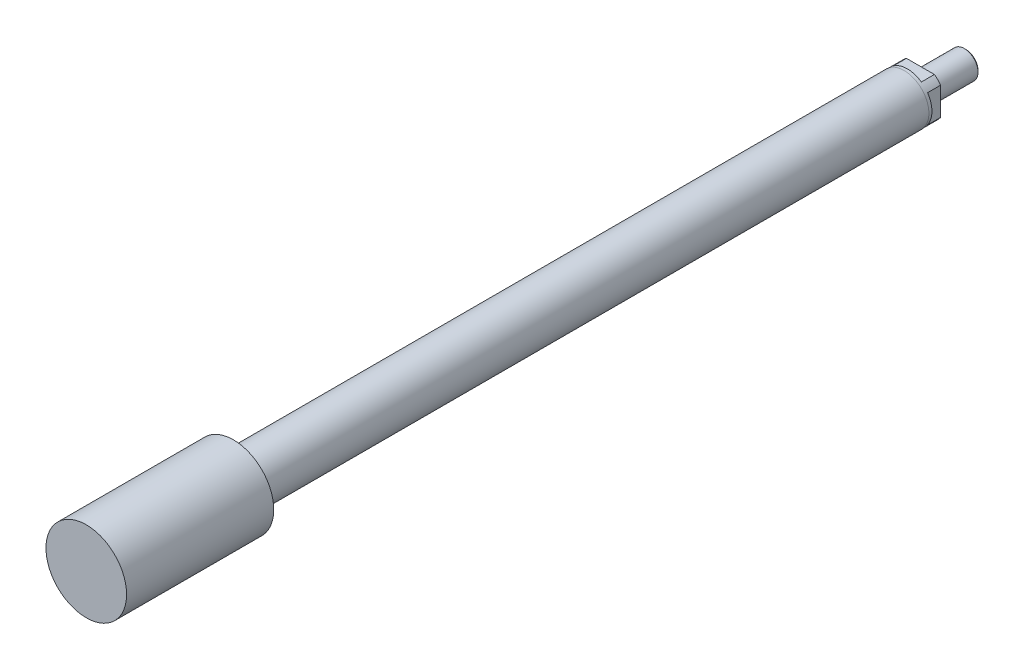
ISO-10303-21;
HEADER;
FILE_DESCRIPTION(('STEP AP214'),'2;1');
FILE_NAME('part.step','',(''),(''),'','','');
FILE_SCHEMA(('AUTOMOTIVE_DESIGN { 1 0 10303 214 1 1 1 1 }'));
ENDSEC;
DATA;
#1=APPLICATION_CONTEXT('core data for automotive mechanical design processes');
#2=APPLICATION_PROTOCOL_DEFINITION('international standard','automotive_design',2000,#1);
#3=PRODUCT_CONTEXT('',#1,'mechanical');
#4=PRODUCT('Part','Part','',(#3));
#5=PRODUCT_RELATED_PRODUCT_CATEGORY('part','',(#4));
#6=PRODUCT_DEFINITION_FORMATION('','',#4);
#7=PRODUCT_DEFINITION_CONTEXT('part definition',#1,'design');
#8=PRODUCT_DEFINITION('design','',#6,#7);
#9=PRODUCT_DEFINITION_SHAPE('','',#8);
#10=(LENGTH_UNIT() NAMED_UNIT(*) SI_UNIT(.MILLI.,.METRE.));
#11=(NAMED_UNIT(*) PLANE_ANGLE_UNIT() SI_UNIT($,.RADIAN.));
#12=(NAMED_UNIT(*) SI_UNIT($,.STERADIAN.) SOLID_ANGLE_UNIT());
#13=UNCERTAINTY_MEASURE_WITH_UNIT(LENGTH_MEASURE(1.E-05),#10,'distance_accuracy_value','');
#14=(GEOMETRIC_REPRESENTATION_CONTEXT(3) GLOBAL_UNCERTAINTY_ASSIGNED_CONTEXT((#13)) GLOBAL_UNIT_ASSIGNED_CONTEXT((#10,
#11,#12)) REPRESENTATION_CONTEXT('',''));
#15=CARTESIAN_POINT('',(0.,0.,0.));
#16=DIRECTION('',(0.,0.,1.));
#17=DIRECTION('',(1.,0.,0.));
#18=AXIS2_PLACEMENT_3D('',#15,#16,#17);
#19=CARTESIAN_POINT('',(0.,-37.719,-1161.15216));
#20=DIRECTION('',(0.,0.,1.));
#21=DIRECTION('',(-1.,0.,0.));
#22=AXIS2_PLACEMENT_3D('',#19,#20,#21);
#23=PLANE('',#22);
#24=CARTESIAN_POINT('',(0.,-2.9091818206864E-13,-1161.15216));
#25=DIRECTION('',(0.,0.,1.));
#26=DIRECTION('',(-1.,0.,0.));
#27=AXIS2_PLACEMENT_3D('',#24,#25,#26);
#28=CIRCLE('',#27,18.495999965);
#29=CARTESIAN_POINT('',(-18.4959999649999,-2.95025119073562E-13,-1161.15216));
#30=VERTEX_POINT('',#29);
#31=EDGE_CURVE('E117',#30,#30,#28,.T.);
#32=ORIENTED_EDGE('',*,*,#31,.T.);
#33=EDGE_LOOP('',(#32));
#34=FACE_BOUND('',#33,.T.);
#35=DIRECTION('',(0.,1.,0.));
#36=VECTOR('',#35,1.);
#37=CARTESIAN_POINT('',(-31.,-31.,-1161.15216));
#38=LINE('',#37,#36);
#39=CARTESIAN_POINT('',(-31.,-21.487739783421,-1161.15216));
#40=VERTEX_POINT('',#39);
#41=CARTESIAN_POINT('',(-31.,21.4877397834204,-1161.15216));
#42=VERTEX_POINT('',#41);
#43=EDGE_CURVE('E93',#40,#42,#38,.T.);
#44=ORIENTED_EDGE('',*,*,#43,.T.);
#45=CARTESIAN_POINT('',(0.,-2.9091818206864E-13,-1161.15216));
#46=DIRECTION('',(0.,0.,1.));
#47=DIRECTION('',(-1.,0.,0.));
#48=AXIS2_PLACEMENT_3D('',#45,#46,#47);
#49=CIRCLE('',#48,37.719);
#50=CARTESIAN_POINT('',(-21.4877397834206,31.,-1161.15216));
#51=VERTEX_POINT('',#50);
#52=EDGE_CURVE('E101',#51,#42,#49,.T.);
#53=ORIENTED_EDGE('',*,*,#52,.F.);
#54=DIRECTION('',(1.,0.,0.));
#55=VECTOR('',#54,1.);
#56=CARTESIAN_POINT('',(-31.,31.,-1161.15216));
#57=LINE('',#56,#55);
#58=CARTESIAN_POINT('',(21.4877397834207,31.,-1161.15216));
#59=VERTEX_POINT('',#58);
#60=EDGE_CURVE('E81',#51,#59,#57,.T.);
#61=ORIENTED_EDGE('',*,*,#60,.T.);
#62=CARTESIAN_POINT('',(31.,21.4877397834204,-1161.15216));
#63=VERTEX_POINT('',#62);
#64=EDGE_CURVE('E108',#63,#59,#49,.T.);
#65=ORIENTED_EDGE('',*,*,#64,.F.);
#66=DIRECTION('',(0.,-1.,0.));
#67=VECTOR('',#66,1.);
#68=CARTESIAN_POINT('',(31.,-31.,-1161.15216));
#69=LINE('',#68,#67);
#70=CARTESIAN_POINT('',(31.,-21.487739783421,-1161.15216));
#71=VERTEX_POINT('',#70);
#72=EDGE_CURVE('E92',#63,#71,#69,.T.);
#73=ORIENTED_EDGE('',*,*,#72,.T.);
#74=CARTESIAN_POINT('',(21.4877397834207,-31.,-1161.15216));
#75=VERTEX_POINT('',#74);
#76=EDGE_CURVE('E112',#75,#71,#49,.T.);
#77=ORIENTED_EDGE('',*,*,#76,.F.);
#78=DIRECTION('',(-1.,0.,0.));
#79=VECTOR('',#78,1.);
#80=CARTESIAN_POINT('',(-31.,-31.,-1161.15216));
#81=LINE('',#80,#79);
#82=CARTESIAN_POINT('',(-21.4877397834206,-31.,-1161.15216));
#83=VERTEX_POINT('',#82);
#84=EDGE_CURVE('E130',#75,#83,#81,.T.);
#85=ORIENTED_EDGE('',*,*,#84,.T.);
#86=EDGE_CURVE('E111',#40,#83,#49,.T.);
#87=ORIENTED_EDGE('',*,*,#86,.F.);
#88=EDGE_LOOP('',(#44,#53,#61,#65,#73,#77,#85,#87));
#89=FACE_BOUND('',#88,.T.);
#90=ADVANCED_FACE('F16',(#34,#89),#23,.F.);
#91=CARTESIAN_POINT('',(0.,-2.88030943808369E-13,-1076.00496));
#92=DIRECTION('',(0.,0.,1.));
#93=DIRECTION('',(-1.,0.,0.));
#94=AXIS2_PLACEMENT_3D('',#91,#92,#93);
#95=CYLINDRICAL_SURFACE('',#94,37.719);
#96=CARTESIAN_POINT('',(0.,-2.90070462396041E-13,-1136.15216));
#97=DIRECTION('',(0.,0.,1.));
#98=DIRECTION('',(-1.,0.,0.));
#99=AXIS2_PLACEMENT_3D('',#96,#97,#98);
#100=CIRCLE('',#99,37.719);
#101=CARTESIAN_POINT('',(-37.7189999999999,-2.98445762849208E-13,-1136.15216));
#102=VERTEX_POINT('',#101);
#103=EDGE_CURVE('E109',#102,#102,#100,.T.);
#104=ORIENTED_EDGE('',*,*,#103,.F.);
#105=EDGE_LOOP('',(#104));
#106=FACE_BOUND('',#105,.T.);
#107=DIRECTION('',(0.,0.,1.));
#108=VECTOR('',#107,1.);
#109=CARTESIAN_POINT('',(-31.,-21.487739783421,-1076.00496));
#110=LINE('',#109,#108);
#111=CARTESIAN_POINT('',(-31.,-21.487739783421,-1141.15216));
#112=VERTEX_POINT('',#111);
#113=EDGE_CURVE('E10',#40,#112,#110,.T.);
#114=ORIENTED_EDGE('',*,*,#113,.F.);
#115=ORIENTED_EDGE('',*,*,#86,.T.);
#116=DIRECTION('',(0.,0.,1.));
#117=VECTOR('',#116,1.);
#118=CARTESIAN_POINT('',(-21.4877397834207,-31.,-1076.00496));
#119=LINE('',#118,#117);
#120=CARTESIAN_POINT('',(-21.4877397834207,-31.,-1141.15216));
#121=VERTEX_POINT('',#120);
#122=EDGE_CURVE('E157',#121,#83,#119,.F.);
#123=ORIENTED_EDGE('',*,*,#122,.F.);
#124=CARTESIAN_POINT('',(0.,-2.9024000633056E-13,-1141.15216));
#125=DIRECTION('',(0.,0.,-1.));
#126=DIRECTION('',(1.,0.,0.));
#127=AXIS2_PLACEMENT_3D('',#124,#125,#126);
#128=CIRCLE('',#127,37.719);
#129=CARTESIAN_POINT('',(21.4877397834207,-31.,-1141.15216));
#130=VERTEX_POINT('',#129);
#131=EDGE_CURVE('E159',#130,#121,#128,.T.);
#132=ORIENTED_EDGE('',*,*,#131,.F.);
#133=DIRECTION('',(0.,0.,1.));
#134=VECTOR('',#133,1.);
#135=CARTESIAN_POINT('',(21.4877397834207,-31.,-1076.00496));
#136=LINE('',#135,#134);
#137=EDGE_CURVE('E127',#75,#130,#136,.T.);
#138=ORIENTED_EDGE('',*,*,#137,.F.);
#139=ORIENTED_EDGE('',*,*,#76,.T.);
#140=DIRECTION('',(0.,0.,1.));
#141=VECTOR('',#140,1.);
#142=CARTESIAN_POINT('',(31.,-21.487739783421,-1076.00496));
#143=LINE('',#142,#141);
#144=CARTESIAN_POINT('',(31.,-21.487739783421,-1141.15216));
#145=VERTEX_POINT('',#144);
#146=EDGE_CURVE('E104',#145,#71,#143,.F.);
#147=ORIENTED_EDGE('',*,*,#146,.F.);
#148=CARTESIAN_POINT('',(31.,21.4877397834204,-1141.15216));
#149=VERTEX_POINT('',#148);
#150=EDGE_CURVE('E146',#149,#145,#128,.T.);
#151=ORIENTED_EDGE('',*,*,#150,.F.);
#152=DIRECTION('',(0.,0.,1.));
#153=VECTOR('',#152,1.);
#154=CARTESIAN_POINT('',(31.,21.4877397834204,-1076.00496));
#155=LINE('',#154,#153);
#156=EDGE_CURVE('E155',#63,#149,#155,.T.);
#157=ORIENTED_EDGE('',*,*,#156,.F.);
#158=ORIENTED_EDGE('',*,*,#64,.T.);
#159=DIRECTION('',(0.,0.,1.));
#160=VECTOR('',#159,1.);
#161=CARTESIAN_POINT('',(21.4877397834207,31.,-1076.00496));
#162=LINE('',#161,#160);
#163=CARTESIAN_POINT('',(21.4877397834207,31.,-1141.15216));
#164=VERTEX_POINT('',#163);
#165=EDGE_CURVE('E87',#164,#59,#162,.F.);
#166=ORIENTED_EDGE('',*,*,#165,.F.);
#167=CARTESIAN_POINT('',(-21.4877397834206,31.,-1141.15216));
#168=VERTEX_POINT('',#167);
#169=EDGE_CURVE('E103',#168,#164,#128,.T.);
#170=ORIENTED_EDGE('',*,*,#169,.F.);
#171=DIRECTION('',(0.,0.,1.));
#172=VECTOR('',#171,1.);
#173=CARTESIAN_POINT('',(-21.4877397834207,31.,-1076.00496));
#174=LINE('',#173,#172);
#175=EDGE_CURVE('E84',#51,#168,#174,.T.);
#176=ORIENTED_EDGE('',*,*,#175,.F.);
#177=ORIENTED_EDGE('',*,*,#52,.T.);
#178=DIRECTION('',(0.,0.,1.));
#179=VECTOR('',#178,1.);
#180=CARTESIAN_POINT('',(-31.,21.4877397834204,-1076.00496));
#181=LINE('',#180,#179);
#182=CARTESIAN_POINT('',(-31.,21.4877397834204,-1141.15216));
#183=VERTEX_POINT('',#182);
#184=EDGE_CURVE('E161',#183,#42,#181,.F.);
#185=ORIENTED_EDGE('',*,*,#184,.F.);
#186=EDGE_CURVE('E25',#112,#183,#128,.T.);
#187=ORIENTED_EDGE('',*,*,#186,.F.);
#188=EDGE_LOOP('',(#114,#115,#123,#132,#138,#139,#147,#151,#157,#158,#166,#170,#176,#177,#185,#187));
#189=FACE_BOUND('',#188,.T.);
#190=ADVANCED_FACE('F99',(#106,#189),#95,.T.);
#191=CARTESIAN_POINT('',(0.,-2.93286710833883E-13,-1231.00216));
#192=DIRECTION('',(0.,0.,1.));
#193=DIRECTION('',(-1.,0.,0.));
#194=AXIS2_PLACEMENT_3D('',#191,#192,#193);
#195=PLANE('',#194);
#196=CARTESIAN_POINT('',(0.,-2.93286710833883E-13,-1231.00216));
#197=DIRECTION('',(0.,0.,1.));
#198=DIRECTION('',(-1.,0.,0.));
#199=AXIS2_PLACEMENT_3D('',#196,#197,#198);
#200=CIRCLE('',#199,18.714);
#201=CARTESIAN_POINT('',(-18.7139999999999,-2.9744205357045E-13,-1231.00216));
#202=VERTEX_POINT('',#201);
#203=EDGE_CURVE('E147',#202,#202,#200,.F.);
#204=ORIENTED_EDGE('',*,*,#203,.T.);
#205=EDGE_LOOP('',(#204));
#206=FACE_BOUND('',#205,.T.);
#207=ADVANCED_FACE('F222',(#206),#195,.F.);
#208=CARTESIAN_POINT('',(0.,-2.88030943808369E-13,-1076.00496));
#209=DIRECTION('',(0.,0.,1.));
#210=DIRECTION('',(-1.,0.,0.));
#211=AXIS2_PLACEMENT_3D('',#208,#209,#210);
#212=CYLINDRICAL_SURFACE('',#211,21.);
#213=CARTESIAN_POINT('',(0.,-2.9320919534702E-13,-1228.71616));
#214=DIRECTION('',(0.,0.,1.));
#215=DIRECTION('',(-1.,0.,0.));
#216=AXIS2_PLACEMENT_3D('',#213,#214,#215);
#217=CIRCLE('',#216,21.);
#218=CARTESIAN_POINT('',(-20.9999999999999,-2.97872132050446E-13,-1228.71616));
#219=VERTEX_POINT('',#218);
#220=EDGE_CURVE('E150',#219,#219,#217,.T.);
#221=ORIENTED_EDGE('',*,*,#220,.T.);
#222=EDGE_LOOP('',(#221));
#223=FACE_BOUND('',#222,.T.);
#224=CARTESIAN_POINT('',(0.,-2.91142115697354E-13,-1167.75616));
#225=DIRECTION('',(0.,0.,1.));
#226=DIRECTION('',(-1.,0.,0.));
#227=AXIS2_PLACEMENT_3D('',#224,#225,#226);
#228=CIRCLE('',#227,21.);
#229=CARTESIAN_POINT('',(-20.9999999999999,-2.9580505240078E-13,-1167.75616));
#230=VERTEX_POINT('',#229);
#231=EDGE_CURVE('E451',#230,#230,#228,.T.);
#232=ORIENTED_EDGE('',*,*,#231,.F.);
#233=EDGE_LOOP('',(#232));
#234=FACE_BOUND('',#233,.T.);
#235=ADVANCED_FACE('F225',(#223,#234),#212,.T.);
#236=CARTESIAN_POINT('',(0.,-21.0000000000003,-1167.75616));
#237=DIRECTION('',(0.,0.,-1.));
#238=DIRECTION('',(1.,0.,0.));
#239=AXIS2_PLACEMENT_3D('',#236,#237,#238);
#240=PLANE('',#239);
#241=CARTESIAN_POINT('',(0.,-2.91142115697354E-13,-1167.75616));
#242=DIRECTION('',(0.,0.,1.));
#243=DIRECTION('',(-1.,0.,0.));
#244=AXIS2_PLACEMENT_3D('',#241,#242,#243);
#245=CIRCLE('',#244,18.495999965);
#246=CARTESIAN_POINT('',(-18.4959999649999,-2.95249052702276E-13,-1167.75616));
#247=VERTEX_POINT('',#246);
#248=EDGE_CURVE('E120',#247,#247,#245,.T.);
#249=ORIENTED_EDGE('',*,*,#248,.F.);
#250=EDGE_LOOP('',(#249));
#251=FACE_BOUND('',#250,.T.);
#252=ORIENTED_EDGE('',*,*,#231,.T.);
#253=EDGE_LOOP('',(#252));
#254=FACE_BOUND('',#253,.T.);
#255=ADVANCED_FACE('F229',(#251,#254),#240,.F.);
#256=CARTESIAN_POINT('',(0.,-2.88030943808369E-13,-1076.00496));
#257=DIRECTION('',(0.,0.,1.));
#258=DIRECTION('',(-1.,0.,0.));
#259=AXIS2_PLACEMENT_3D('',#256,#257,#258);
#260=CYLINDRICAL_SURFACE('',#259,18.495999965);
#261=ORIENTED_EDGE('',*,*,#31,.F.);
#262=EDGE_LOOP('',(#261));
#263=FACE_BOUND('',#262,.T.);
#264=ORIENTED_EDGE('',*,*,#248,.T.);
#265=EDGE_LOOP('',(#264));
#266=FACE_BOUND('',#265,.T.);
#267=ADVANCED_FACE('F220',(#263,#266),#260,.T.);
#268=CARTESIAN_POINT('',(0.,-2.9320919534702E-13,-1228.71616));
#269=DIRECTION('',(0.,0.,1.));
#270=DIRECTION('',(-1.,0.,0.));
#271=AXIS2_PLACEMENT_3D('',#268,#269,#270);
#272=CONICAL_SURFACE('',#271,21.,0.785398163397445);
#273=ORIENTED_EDGE('',*,*,#203,.F.);
#274=EDGE_LOOP('',(#273));
#275=FACE_BOUND('',#274,.T.);
#276=ORIENTED_EDGE('',*,*,#220,.F.);
#277=EDGE_LOOP('',(#276));
#278=FACE_BOUND('',#277,.T.);
#279=ADVANCED_FACE('F217',(#275,#278),#272,.T.);
#280=CARTESIAN_POINT('',(-31.,31.,-1141.15216));
#281=DIRECTION('',(0.,1.,0.));
#282=DIRECTION('',(0.,0.,-1.));
#283=AXIS2_PLACEMENT_3D('',#280,#281,#282);
#284=PLANE('',#283);
#285=ORIENTED_EDGE('',*,*,#175,.T.);
#286=DIRECTION('',(1.,0.,0.));
#287=VECTOR('',#286,1.);
#288=CARTESIAN_POINT('',(-31.,31.,-1141.15216));
#289=LINE('',#288,#287);
#290=EDGE_CURVE('E141',#168,#164,#289,.T.);
#291=ORIENTED_EDGE('',*,*,#290,.T.);
#292=ORIENTED_EDGE('',*,*,#165,.T.);
#293=ORIENTED_EDGE('',*,*,#60,.F.);
#294=EDGE_LOOP('',(#285,#291,#292,#293));
#295=FACE_BOUND('',#294,.T.);
#296=ADVANCED_FACE('F83',(#295),#284,.T.);
#297=CARTESIAN_POINT('',(0.,-2.9024000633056E-13,-1141.15216));
#298=DIRECTION('',(0.,0.,-1.));
#299=DIRECTION('',(1.,0.,0.));
#300=AXIS2_PLACEMENT_3D('',#297,#298,#299);
#301=PLANE('',#300);
#302=ORIENTED_EDGE('',*,*,#169,.T.);
#303=ORIENTED_EDGE('',*,*,#290,.F.);
#304=EDGE_LOOP('',(#302,#303));
#305=FACE_BOUND('',#304,.T.);
#306=ADVANCED_FACE('F144',(#305),#301,.T.);
#307=CARTESIAN_POINT('',(31.,-31.,-1141.15216));
#308=DIRECTION('',(1.,0.,0.));
#309=DIRECTION('',(0.,1.,0.));
#310=AXIS2_PLACEMENT_3D('',#307,#308,#309);
#311=PLANE('',#310);
#312=ORIENTED_EDGE('',*,*,#156,.T.);
#313=DIRECTION('',(0.,-1.,0.));
#314=VECTOR('',#313,1.);
#315=CARTESIAN_POINT('',(31.,-31.,-1141.15216));
#316=LINE('',#315,#314);
#317=EDGE_CURVE('E139',#149,#145,#316,.T.);
#318=ORIENTED_EDGE('',*,*,#317,.T.);
#319=ORIENTED_EDGE('',*,*,#146,.T.);
#320=ORIENTED_EDGE('',*,*,#72,.F.);
#321=EDGE_LOOP('',(#312,#318,#319,#320));
#322=FACE_BOUND('',#321,.T.);
#323=ADVANCED_FACE('F251',(#322),#311,.T.);
#324=ORIENTED_EDGE('',*,*,#150,.T.);
#325=ORIENTED_EDGE('',*,*,#317,.F.);
#326=EDGE_LOOP('',(#324,#325));
#327=FACE_BOUND('',#326,.T.);
#328=ADVANCED_FACE('F247',(#327),#301,.T.);
#329=CARTESIAN_POINT('',(-31.,-31.,-1141.15216));
#330=DIRECTION('',(0.,-1.,0.));
#331=DIRECTION('',(0.,0.,1.));
#332=AXIS2_PLACEMENT_3D('',#329,#330,#331);
#333=PLANE('',#332);
#334=ORIENTED_EDGE('',*,*,#137,.T.);
#335=DIRECTION('',(-1.,0.,0.));
#336=VECTOR('',#335,1.);
#337=CARTESIAN_POINT('',(-31.,-31.,-1141.15216));
#338=LINE('',#337,#336);
#339=EDGE_CURVE('E40',#130,#121,#338,.T.);
#340=ORIENTED_EDGE('',*,*,#339,.T.);
#341=ORIENTED_EDGE('',*,*,#122,.T.);
#342=ORIENTED_EDGE('',*,*,#84,.F.);
#343=EDGE_LOOP('',(#334,#340,#341,#342));
#344=FACE_BOUND('',#343,.T.);
#345=ADVANCED_FACE('F245',(#344),#333,.T.);
#346=ORIENTED_EDGE('',*,*,#131,.T.);
#347=ORIENTED_EDGE('',*,*,#339,.F.);
#348=EDGE_LOOP('',(#346,#347));
#349=FACE_BOUND('',#348,.T.);
#350=ADVANCED_FACE('F243',(#349),#301,.T.);
#351=ORIENTED_EDGE('',*,*,#186,.T.);
#352=DIRECTION('',(0.,1.,0.));
#353=VECTOR('',#352,1.);
#354=CARTESIAN_POINT('',(-31.,-31.,-1141.15216));
#355=LINE('',#354,#353);
#356=EDGE_CURVE('E32',#112,#183,#355,.T.);
#357=ORIENTED_EDGE('',*,*,#356,.F.);
#358=EDGE_LOOP('',(#351,#357));
#359=FACE_BOUND('',#358,.T.);
#360=ADVANCED_FACE('F199',(#359),#301,.T.);
#361=CARTESIAN_POINT('',(-31.,-31.,-1141.15216));
#362=DIRECTION('',(-1.,0.,0.));
#363=DIRECTION('',(0.,-1.,0.));
#364=AXIS2_PLACEMENT_3D('',#361,#362,#363);
#365=PLANE('',#364);
#366=ORIENTED_EDGE('',*,*,#113,.T.);
#367=ORIENTED_EDGE('',*,*,#356,.T.);
#368=ORIENTED_EDGE('',*,*,#184,.T.);
#369=ORIENTED_EDGE('',*,*,#43,.F.);
#370=EDGE_LOOP('',(#366,#367,#368,#369));
#371=FACE_BOUND('',#370,.T.);
#372=ADVANCED_FACE('F191',(#371),#365,.T.);
#373=CARTESIAN_POINT('',(-2.6719735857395E-13,-2.53319570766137E-13,121.22785));
#374=DIRECTION('',(0.,0.,-1.));
#375=DIRECTION('',(-0.707106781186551,-0.707106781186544,0.));
#376=AXIS2_PLACEMENT_3D('',#373,#374,#375);
#377=PLANE('',#376);
#378=CARTESIAN_POINT('',(-2.6719735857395E-13,-2.53319570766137E-13,121.22785));
#379=DIRECTION('',(0.,0.,-1.));
#380=DIRECTION('',(-0.707106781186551,-0.707106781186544,0.));
#381=AXIS2_PLACEMENT_3D('',#378,#379,#380);
#382=CIRCLE('',#381,61.976);
#383=CARTESIAN_POINT('',(-43.823649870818,-43.8236498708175,121.22785));
#384=VERTEX_POINT('',#383);
#385=EDGE_CURVE('E20',#384,#384,#382,.T.);
#386=ORIENTED_EDGE('',*,*,#385,.F.);
#387=EDGE_LOOP('',(#386));
#388=FACE_BOUND('',#387,.T.);
#389=ADVANCED_FACE('F180',(#388),#377,.F.);
#390=CARTESIAN_POINT('',(-2.70337085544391E-13,-2.56459297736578E-13,-88.138));
#391=DIRECTION('',(0.,0.,1.));
#392=DIRECTION('',(0.707106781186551,0.707106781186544,0.));
#393=AXIS2_PLACEMENT_3D('',#390,#391,#392);
#394=CYLINDRICAL_SURFACE('',#393,61.976);
#395=ORIENTED_EDGE('',*,*,#385,.T.);
#396=EDGE_LOOP('',(#395));
#397=FACE_BOUND('',#396,.T.);
#398=CARTESIAN_POINT('',(-2.70590198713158E-13,-2.56712410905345E-13,-105.0163));
#399=DIRECTION('',(0.,0.,-1.));
#400=DIRECTION('',(-0.707106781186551,-0.707106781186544,0.));
#401=AXIS2_PLACEMENT_3D('',#398,#399,#400);
#402=CIRCLE('',#401,61.976);
#403=CARTESIAN_POINT('',(-43.823649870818,-43.8236498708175,-105.0163));
#404=VERTEX_POINT('',#403);
#405=EDGE_CURVE('E166',#404,#404,#402,.T.);
#406=ORIENTED_EDGE('',*,*,#405,.F.);
#407=EDGE_LOOP('',(#406));
#408=FACE_BOUND('',#407,.T.);
#409=ADVANCED_FACE('F18',(#397,#408),#394,.T.);
#410=CARTESIAN_POINT('',(-2.70590198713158E-13,-2.56712410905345E-13,-105.0163));
#411=DIRECTION('',(0.,0.,-1.));
#412=DIRECTION('',(-0.707106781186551,-0.707106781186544,0.));
#413=AXIS2_PLACEMENT_3D('',#410,#411,#412);
#414=PLANE('',#413);
#415=CARTESIAN_POINT('',(-2.70590198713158E-13,-2.56712410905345E-13,-105.0163));
#416=DIRECTION('',(0.,0.,-1.));
#417=DIRECTION('',(-0.707106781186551,-0.707106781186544,0.));
#418=AXIS2_PLACEMENT_3D('',#415,#416,#417);
#419=CIRCLE('',#418,51.6001);
#420=CARTESIAN_POINT('',(-36.4867806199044,-36.486780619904,-105.0163));
#421=VERTEX_POINT('',#420);
#422=EDGE_CURVE('E169',#421,#421,#419,.T.);
#423=ORIENTED_EDGE('',*,*,#422,.F.);
#424=EDGE_LOOP('',(#423));
#425=FACE_BOUND('',#424,.T.);
#426=ORIENTED_EDGE('',*,*,#405,.T.);
#427=EDGE_LOOP('',(#426));
#428=FACE_BOUND('',#427,.T.);
#429=ADVANCED_FACE('F177',(#425,#428),#414,.T.);
#430=CARTESIAN_POINT('',(-2.70590198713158E-13,-2.56712410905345E-13,-105.0163));
#431=DIRECTION('',(0.,0.,-1.));
#432=DIRECTION('',(-0.707106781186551,-0.707106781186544,0.));
#433=AXIS2_PLACEMENT_3D('',#430,#431,#432);
#434=CYLINDRICAL_SURFACE('',#433,51.6001);
#435=ORIENTED_EDGE('',*,*,#422,.T.);
#436=EDGE_LOOP('',(#435));
#437=FACE_BOUND('',#436,.T.);
#438=CARTESIAN_POINT('',(-2.70685425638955E-13,-2.56807637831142E-13,-111.3663));
#439=DIRECTION('',(0.,0.,-1.));
#440=DIRECTION('',(-0.707106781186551,-0.707106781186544,0.));
#441=AXIS2_PLACEMENT_3D('',#438,#439,#440);
#442=CIRCLE('',#441,51.6001);
#443=CARTESIAN_POINT('',(-36.4867806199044,-36.486780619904,-111.3663));
#444=VERTEX_POINT('',#443);
#445=EDGE_CURVE('E172',#444,#444,#442,.T.);
#446=ORIENTED_EDGE('',*,*,#445,.F.);
#447=EDGE_LOOP('',(#446));
#448=FACE_BOUND('',#447,.T.);
#449=ADVANCED_FACE('F188',(#437,#448),#434,.T.);
#450=CARTESIAN_POINT('',(-2.70685425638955E-13,-2.56807637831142E-13,-111.3663));
#451=DIRECTION('',(0.,0.,-1.));
#452=DIRECTION('',(-0.707106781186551,-0.707106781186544,0.));
#453=AXIS2_PLACEMENT_3D('',#450,#451,#452);
#454=PLANE('',#453);
#455=CARTESIAN_POINT('',(-1.07372548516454E-13,0.,-111.3663));
#456=DIRECTION('',(0.,0.,-1.));
#457=DIRECTION('',(-1.,0.,0.));
#458=AXIS2_PLACEMENT_3D('',#455,#456,#457);
#459=CIRCLE('',#458,38.05174);
#460=CARTESIAN_POINT('',(-38.0517400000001,0.,-111.3663));
#461=VERTEX_POINT('',#460);
#462=EDGE_CURVE('E137',#461,#461,#459,.F.);
#463=ORIENTED_EDGE('',*,*,#462,.T.);
#464=EDGE_LOOP('',(#463));
#465=FACE_BOUND('',#464,.T.);
#466=ORIENTED_EDGE('',*,*,#445,.T.);
#467=EDGE_LOOP('',(#466));
#468=FACE_BOUND('',#467,.T.);
#469=ADVANCED_FACE('F202',(#465,#468),#454,.T.);
#470=CARTESIAN_POINT('',(-1.07372548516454E-13,0.,-183.276681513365));
#471=DIRECTION('',(0.,0.,1.));
#472=DIRECTION('',(1.,0.,0.));
#473=AXIS2_PLACEMENT_3D('',#470,#471,#472);
#474=CYLINDRICAL_SURFACE('',#473,38.05174);
#475=ORIENTED_EDGE('',*,*,#462,.F.);
#476=EDGE_LOOP('',(#475));
#477=FACE_BOUND('',#476,.T.);
#478=CARTESIAN_POINT('',(-1.07372548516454E-13,0.,-1136.15216));
#479=DIRECTION('',(0.,0.,1.));
#480=DIRECTION('',(1.,0.,0.));
#481=AXIS2_PLACEMENT_3D('',#478,#479,#480);
#482=CIRCLE('',#481,38.05174);
#483=CARTESIAN_POINT('',(38.0517399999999,0.,-1136.15216));
#484=VERTEX_POINT('',#483);
#485=EDGE_CURVE('E163',#484,#484,#482,.T.);
#486=ORIENTED_EDGE('',*,*,#485,.T.);
#487=EDGE_LOOP('',(#486));
#488=FACE_BOUND('',#487,.T.);
#489=ADVANCED_FACE('F204',(#477,#488),#474,.T.);
#490=CARTESIAN_POINT('',(-1.07372548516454E-13,0.,-1136.15216));
#491=DIRECTION('',(0.,0.,1.));
#492=DIRECTION('',(1.,0.,0.));
#493=AXIS2_PLACEMENT_3D('',#490,#491,#492);
#494=PLANE('',#493);
#495=ORIENTED_EDGE('',*,*,#103,.T.);
#496=EDGE_LOOP('',(#495));
#497=FACE_BOUND('',#496,.T.);
#498=ORIENTED_EDGE('',*,*,#485,.F.);
#499=EDGE_LOOP('',(#498));
#500=FACE_BOUND('',#499,.T.);
#501=ADVANCED_FACE('F212',(#497,#500),#494,.F.);
#502=CLOSED_SHELL('',(#90,#190,#207,#235,#255,#267,#279,#296,#306,#323,#328,#345,#350,#360,#372,
#389,#409,#429,#449,#469,#489,#501));
#503=MANIFOLD_SOLID_BREP('B1',#502);
#504=ADVANCED_BREP_SHAPE_REPRESENTATION('',(#18,#503),#14);
#505=SHAPE_DEFINITION_REPRESENTATION(#9,#504);
ENDSEC;
END-ISO-10303-21;
